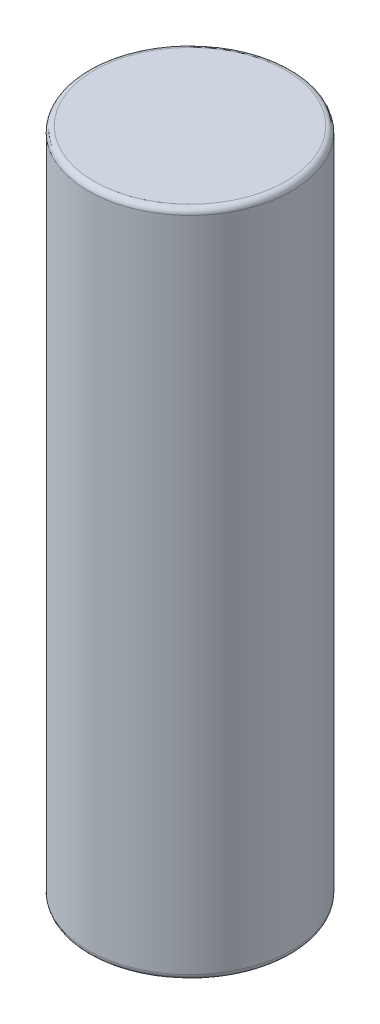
ISO-10303-21;
HEADER;
FILE_DESCRIPTION(('STEP AP214'),'2;1');
FILE_NAME('part.step','',(''),(''),'','','');
FILE_SCHEMA(('AUTOMOTIVE_DESIGN { 1 0 10303 214 1 1 1 1 }'));
ENDSEC;
DATA;
#1=APPLICATION_CONTEXT('core data for automotive mechanical design processes');
#2=APPLICATION_PROTOCOL_DEFINITION('international standard','automotive_design',2000,#1);
#3=PRODUCT_CONTEXT('',#1,'mechanical');
#4=PRODUCT('Part','Part','',(#3));
#5=PRODUCT_RELATED_PRODUCT_CATEGORY('part','',(#4));
#6=PRODUCT_DEFINITION_FORMATION('','',#4);
#7=PRODUCT_DEFINITION_CONTEXT('part definition',#1,'design');
#8=PRODUCT_DEFINITION('design','',#6,#7);
#9=PRODUCT_DEFINITION_SHAPE('','',#8);
#10=(LENGTH_UNIT() NAMED_UNIT(*) SI_UNIT(.MILLI.,.METRE.));
#11=(NAMED_UNIT(*) PLANE_ANGLE_UNIT() SI_UNIT($,.RADIAN.));
#12=(NAMED_UNIT(*) SI_UNIT($,.STERADIAN.) SOLID_ANGLE_UNIT());
#13=UNCERTAINTY_MEASURE_WITH_UNIT(LENGTH_MEASURE(1.E-05),#10,'distance_accuracy_value','');
#14=(GEOMETRIC_REPRESENTATION_CONTEXT(3) GLOBAL_UNCERTAINTY_ASSIGNED_CONTEXT((#13)) GLOBAL_UNIT_ASSIGNED_CONTEXT((#10,
#11,#12)) REPRESENTATION_CONTEXT('',''));
#15=CARTESIAN_POINT('',(0.,0.,0.));
#16=DIRECTION('',(0.,0.,1.));
#17=DIRECTION('',(1.,0.,0.));
#18=AXIS2_PLACEMENT_3D('',#15,#16,#17);
#19=CARTESIAN_POINT('',(0.,70.7,0.));
#20=DIRECTION('',(0.,-1.,0.));
#21=DIRECTION('',(0.,0.,-1.));
#22=AXIS2_PLACEMENT_3D('',#19,#20,#21);
#23=CYLINDRICAL_SURFACE('',#22,10.75);
#24=CARTESIAN_POINT('',(0.,0.600000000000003,0.));
#25=DIRECTION('',(0.,1.,0.));
#26=DIRECTION('',(0.,0.,1.));
#27=AXIS2_PLACEMENT_3D('',#24,#25,#26);
#28=CIRCLE('',#27,10.75);
#29=CARTESIAN_POINT('',(0.,0.600000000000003,10.75));
#30=VERTEX_POINT('',#29);
#31=EDGE_CURVE('E58',#30,#30,#28,.T.);
#32=ORIENTED_EDGE('',*,*,#31,.T.);
#33=EDGE_LOOP('',(#32));
#34=FACE_BOUND('',#33,.T.);
#35=CARTESIAN_POINT('',(0.,70.1,0.));
#36=DIRECTION('',(0.,1.,0.));
#37=DIRECTION('',(0.,0.,1.));
#38=AXIS2_PLACEMENT_3D('',#35,#36,#37);
#39=CIRCLE('',#38,10.75);
#40=CARTESIAN_POINT('',(0.,70.1,10.75));
#41=VERTEX_POINT('',#40);
#42=EDGE_CURVE('E62',#41,#41,#39,.F.);
#43=ORIENTED_EDGE('',*,*,#42,.T.);
#44=EDGE_LOOP('',(#43));
#45=FACE_BOUND('',#44,.T.);
#46=ADVANCED_FACE('F43',(#34,#45),#23,.T.);
#47=CARTESIAN_POINT('',(0.,70.7,0.));
#48=DIRECTION('',(0.,1.,0.));
#49=DIRECTION('',(0.,0.,1.));
#50=AXIS2_PLACEMENT_3D('',#47,#48,#49);
#51=PLANE('',#50);
#52=CARTESIAN_POINT('',(0.,70.7,0.));
#53=DIRECTION('',(0.,1.,0.));
#54=DIRECTION('',(0.,0.,1.));
#55=AXIS2_PLACEMENT_3D('',#52,#53,#54);
#56=CIRCLE('',#55,10.15);
#57=CARTESIAN_POINT('',(0.,70.7,10.15));
#58=VERTEX_POINT('',#57);
#59=EDGE_CURVE('E10',#58,#58,#56,.T.);
#60=ORIENTED_EDGE('',*,*,#59,.T.);
#61=EDGE_LOOP('',(#60));
#62=FACE_BOUND('',#61,.T.);
#63=ADVANCED_FACE('F78',(#62),#51,.T.);
#64=CARTESIAN_POINT('',(0.,0.,0.));
#65=DIRECTION('',(0.,1.,0.));
#66=DIRECTION('',(0.,0.,1.));
#67=AXIS2_PLACEMENT_3D('',#64,#65,#66);
#68=PLANE('',#67);
#69=CARTESIAN_POINT('',(0.,0.,0.));
#70=DIRECTION('',(0.,1.,0.));
#71=DIRECTION('',(0.,0.,1.));
#72=AXIS2_PLACEMENT_3D('',#69,#70,#71);
#73=CIRCLE('',#72,10.15);
#74=CARTESIAN_POINT('',(0.,0.,10.15));
#75=VERTEX_POINT('',#74);
#76=EDGE_CURVE('E51',#75,#75,#73,.F.);
#77=ORIENTED_EDGE('',*,*,#76,.T.);
#78=EDGE_LOOP('',(#77));
#79=FACE_BOUND('',#78,.T.);
#80=ADVANCED_FACE('F75',(#79),#68,.F.);
#81=CARTESIAN_POINT('',(0.,0.600000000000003,0.));
#82=DIRECTION('',(0.,1.,0.));
#83=DIRECTION('',(0.,0.,1.));
#84=AXIS2_PLACEMENT_3D('',#81,#82,#83);
#85=TOROIDAL_SURFACE('',#84,10.15,0.6);
#86=ORIENTED_EDGE('',*,*,#76,.F.);
#87=EDGE_LOOP('',(#86));
#88=FACE_BOUND('',#87,.T.);
#89=ORIENTED_EDGE('',*,*,#31,.F.);
#90=EDGE_LOOP('',(#89));
#91=FACE_BOUND('',#90,.T.);
#92=ADVANCED_FACE('F71',(#88,#91),#85,.T.);
#93=CARTESIAN_POINT('',(0.,70.1,0.));
#94=DIRECTION('',(0.,1.,0.));
#95=DIRECTION('',(0.,0.,1.));
#96=AXIS2_PLACEMENT_3D('',#93,#94,#95);
#97=TOROIDAL_SURFACE('',#96,10.15,0.6);
#98=ORIENTED_EDGE('',*,*,#42,.F.);
#99=EDGE_LOOP('',(#98));
#100=FACE_BOUND('',#99,.T.);
#101=ORIENTED_EDGE('',*,*,#59,.F.);
#102=EDGE_LOOP('',(#101));
#103=FACE_BOUND('',#102,.T.);
#104=ADVANCED_FACE('F45',(#100,#103),#97,.T.);
#105=CLOSED_SHELL('',(#46,#63,#80,#92,#104));
#106=MANIFOLD_SOLID_BREP('B2',#105);
#107=ADVANCED_BREP_SHAPE_REPRESENTATION('',(#18,#106),#14);
#108=SHAPE_DEFINITION_REPRESENTATION(#9,#107);
ENDSEC;
END-ISO-10303-21;
